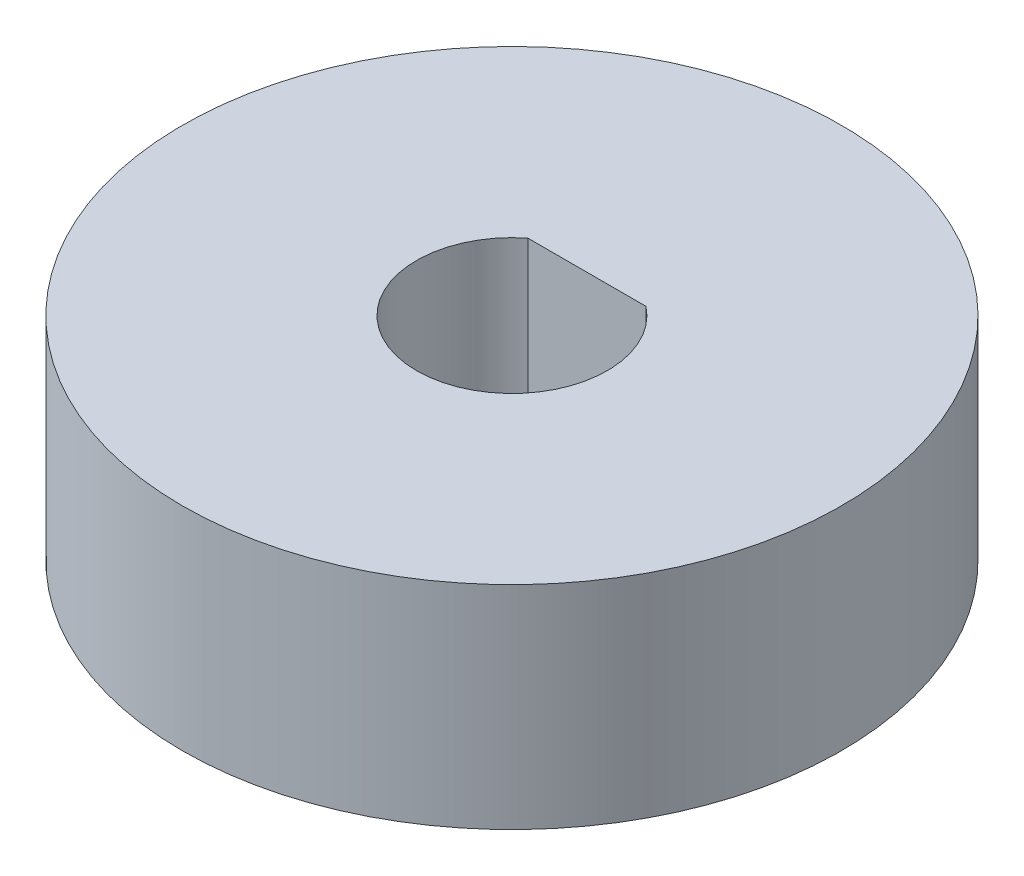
from build123d import *

# Parameters (mm, degrees)
SKETCH1_R      = 10.875
EXTRUDE1_DEPTH = 7


with BuildPart() as part:
    # Sketch1 → Extrude1 (new body)
    with BuildSketch(Plane(origin=(0, 0, 0), x_dir=(1, 0, 0), z_dir=(0, 1, 0))):
        with Locations(Location((0, 0, 0), (0, 0, 270))):
            Circle(SKETCH1_R)
        with BuildLine():
            Line((1.947794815, 2.4756), (-1.947794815, 2.4756))
            ThreePointArc((-1.947794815, 2.4756), (0, -3.15), (1.947794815, 2.4756))
        make_face(mode=Mode.SUBTRACT)
    extrude(amount=EXTRUDE1_DEPTH)


solid = part.part
